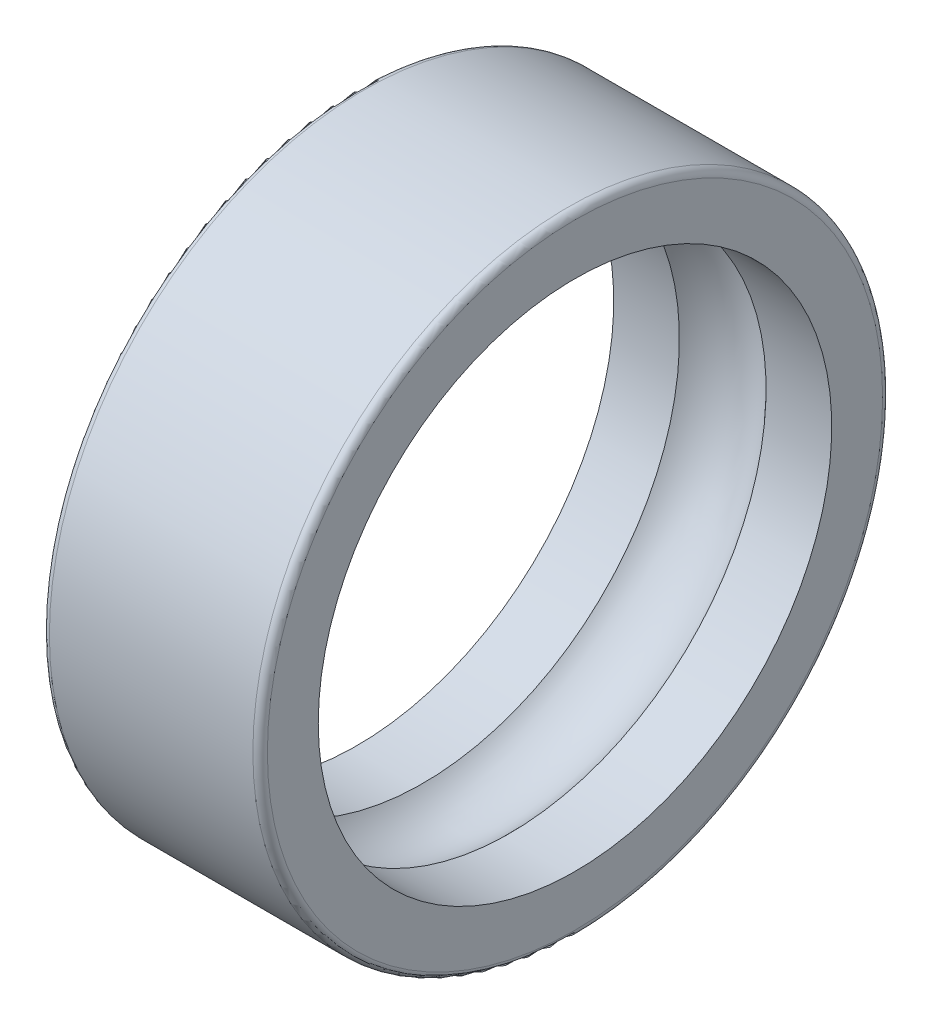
from build123d import *


with BuildPart() as part:
    # Esquisse1 → Base-R_volution (revolve)
    with BuildSketch(Plane(origin=(0, 0, 0), x_dir=(1, 0, 0), z_dir=(0, 1, 0)), mode=Mode.PRIVATE) as base_r_volution_sk:
        with BuildLine():
            Line((0, 12.7), (0, 10.6))
            Line((0, 10.6), (2.711145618, 10.6))
            ThreePointArc((2.711145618, 10.6), (4.5, 11.4), (6.288854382, 10.6))
            Line((6.288854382, 10.6), (9, 10.6))
            Line((9, 10.6), (9, 12.7))
            ThreePointArc((9, 12.7), (8.912132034, 12.912132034), (8.7, 13))
            Line((8.7, 13), (0.3, 13))
            ThreePointArc((0.3, 13), (0.087867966, 12.912132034), (0, 12.7))
        make_face()
    revolve(base_r_volution_sk.sketch.rotate(Axis((0, 0, 0), (1, 0, 0)), 180), axis=Axis((0, 0, 0), (1, 0, 0)))


solid = part.part
